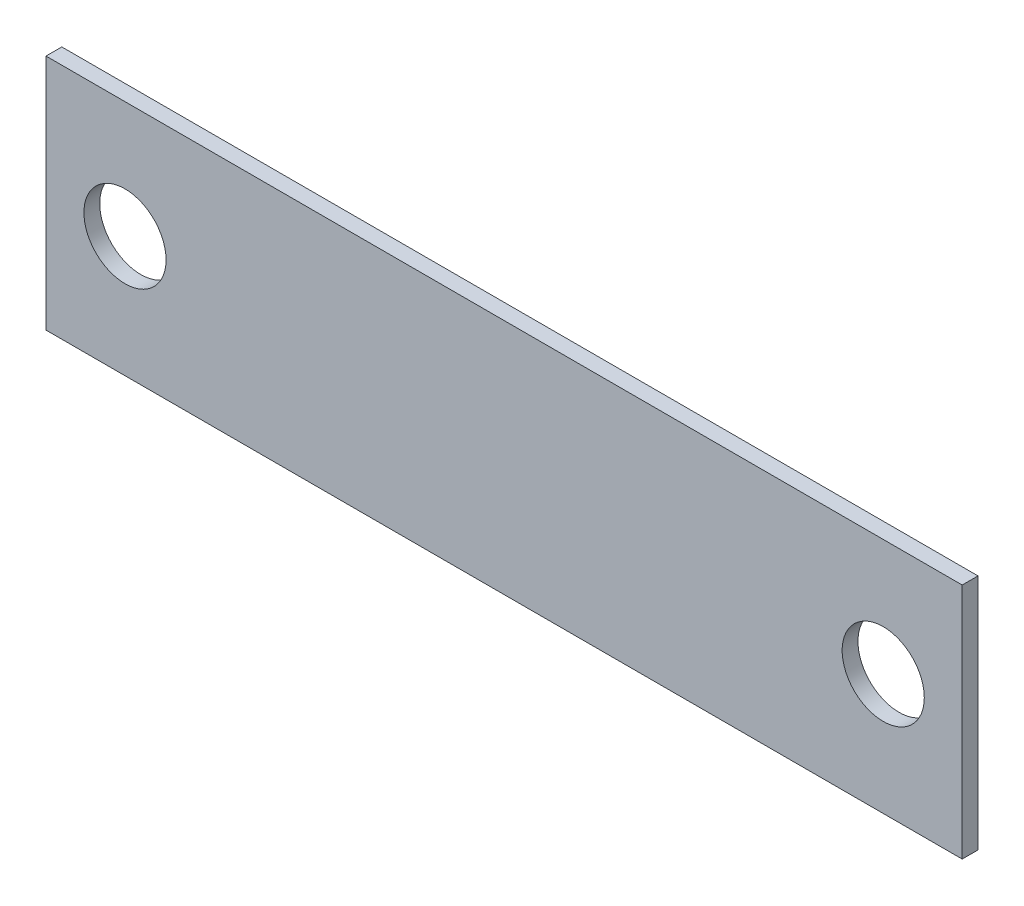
ISO-10303-21;
HEADER;
FILE_DESCRIPTION(('STEP AP214'),'2;1');
FILE_NAME('part.step','',(''),(''),'','','');
FILE_SCHEMA(('AUTOMOTIVE_DESIGN { 1 0 10303 214 1 1 1 1 }'));
ENDSEC;
DATA;
#1=APPLICATION_CONTEXT('core data for automotive mechanical design processes');
#2=APPLICATION_PROTOCOL_DEFINITION('international standard','automotive_design',2000,#1);
#3=PRODUCT_CONTEXT('',#1,'mechanical');
#4=PRODUCT('Part','Part','',(#3));
#5=PRODUCT_RELATED_PRODUCT_CATEGORY('part','',(#4));
#6=PRODUCT_DEFINITION_FORMATION('','',#4);
#7=PRODUCT_DEFINITION_CONTEXT('part definition',#1,'design');
#8=PRODUCT_DEFINITION('design','',#6,#7);
#9=PRODUCT_DEFINITION_SHAPE('','',#8);
#10=(LENGTH_UNIT() NAMED_UNIT(*) SI_UNIT(.MILLI.,.METRE.));
#11=(NAMED_UNIT(*) PLANE_ANGLE_UNIT() SI_UNIT($,.RADIAN.));
#12=(NAMED_UNIT(*) SI_UNIT($,.STERADIAN.) SOLID_ANGLE_UNIT());
#13=UNCERTAINTY_MEASURE_WITH_UNIT(LENGTH_MEASURE(1.E-05),#10,'distance_accuracy_value','');
#14=(GEOMETRIC_REPRESENTATION_CONTEXT(3) GLOBAL_UNCERTAINTY_ASSIGNED_CONTEXT((#13)) GLOBAL_UNIT_ASSIGNED_CONTEXT((#10,
#11,#12)) REPRESENTATION_CONTEXT('',''));
#15=CARTESIAN_POINT('',(0.,0.,0.));
#16=DIRECTION('',(0.,0.,1.));
#17=DIRECTION('',(1.,0.,0.));
#18=AXIS2_PLACEMENT_3D('',#15,#16,#17);
#19=CARTESIAN_POINT('',(-61.5105236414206,29.199175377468,10.));
#20=DIRECTION('',(1.,0.,0.));
#21=DIRECTION('',(0.,1.,0.));
#22=AXIS2_PLACEMENT_3D('',#19,#20,#21);
#23=PLANE('',#22);
#24=DIRECTION('',(0.,-1.,0.));
#25=VECTOR('',#24,1.);
#26=CARTESIAN_POINT('',(-61.5105236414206,29.199175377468,0.));
#27=LINE('',#26,#25);
#28=CARTESIAN_POINT('',(-61.5105236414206,29.199175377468,0.));
#29=VERTEX_POINT('',#28);
#30=CARTESIAN_POINT('',(-61.5105236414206,-121.060824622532,0.));
#31=VERTEX_POINT('',#30);
#32=EDGE_CURVE('E96',#29,#31,#27,.T.);
#33=ORIENTED_EDGE('',*,*,#32,.T.);
#34=DIRECTION('',(0.,0.,-1.));
#35=VECTOR('',#34,1.);
#36=CARTESIAN_POINT('',(-61.5105236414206,-121.060824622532,10.));
#37=LINE('',#36,#35);
#38=CARTESIAN_POINT('',(-61.5105236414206,-121.060824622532,10.));
#39=VERTEX_POINT('',#38);
#40=EDGE_CURVE('E11',#39,#31,#37,.T.);
#41=ORIENTED_EDGE('',*,*,#40,.F.);
#42=DIRECTION('',(0.,-1.,0.));
#43=VECTOR('',#42,1.);
#44=CARTESIAN_POINT('',(-61.5105236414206,29.199175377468,10.));
#45=LINE('',#44,#43);
#46=CARTESIAN_POINT('',(-61.5105236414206,29.199175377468,10.));
#47=VERTEX_POINT('',#46);
#48=EDGE_CURVE('E84',#47,#39,#45,.T.);
#49=ORIENTED_EDGE('',*,*,#48,.F.);
#50=DIRECTION('',(0.,0.,-1.));
#51=VECTOR('',#50,1.);
#52=CARTESIAN_POINT('',(-61.5105236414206,29.199175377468,10.));
#53=LINE('',#52,#51);
#54=EDGE_CURVE('E92',#47,#29,#53,.T.);
#55=ORIENTED_EDGE('',*,*,#54,.T.);
#56=EDGE_LOOP('',(#33,#41,#49,#55));
#57=FACE_BOUND('',#56,.T.);
#58=ADVANCED_FACE('F33',(#57),#23,.F.);
#59=CARTESIAN_POINT('',(-61.5105236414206,-121.060824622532,10.));
#60=DIRECTION('',(0.,1.,0.));
#61=DIRECTION('',(0.,0.,1.));
#62=AXIS2_PLACEMENT_3D('',#59,#60,#61);
#63=PLANE('',#62);
#64=DIRECTION('',(1.,0.,0.));
#65=VECTOR('',#64,1.);
#66=CARTESIAN_POINT('',(-61.5105236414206,-121.060824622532,0.));
#67=LINE('',#66,#65);
#68=CARTESIAN_POINT('',(518.489476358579,-121.060824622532,0.));
#69=VERTEX_POINT('',#68);
#70=EDGE_CURVE('E88',#31,#69,#67,.T.);
#71=ORIENTED_EDGE('',*,*,#70,.T.);
#72=DIRECTION('',(0.,0.,-1.));
#73=VECTOR('',#72,1.);
#74=CARTESIAN_POINT('',(518.489476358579,-121.060824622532,10.));
#75=LINE('',#74,#73);
#76=CARTESIAN_POINT('',(518.489476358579,-121.060824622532,10.));
#77=VERTEX_POINT('',#76);
#78=EDGE_CURVE('E41',#77,#69,#75,.T.);
#79=ORIENTED_EDGE('',*,*,#78,.F.);
#80=DIRECTION('',(1.,0.,0.));
#81=VECTOR('',#80,1.);
#82=CARTESIAN_POINT('',(-61.5105236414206,-121.060824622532,10.));
#83=LINE('',#82,#81);
#84=EDGE_CURVE('E79',#39,#77,#83,.T.);
#85=ORIENTED_EDGE('',*,*,#84,.F.);
#86=ORIENTED_EDGE('',*,*,#40,.T.);
#87=EDGE_LOOP('',(#71,#79,#85,#86));
#88=FACE_BOUND('',#87,.T.);
#89=ADVANCED_FACE('F87',(#88),#63,.F.);
#90=CARTESIAN_POINT('',(518.489476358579,29.1991753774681,10.));
#91=DIRECTION('',(-1.,0.,0.));
#92=DIRECTION('',(0.,0.,1.));
#93=AXIS2_PLACEMENT_3D('',#90,#91,#92);
#94=PLANE('',#93);
#95=DIRECTION('',(0.,1.,0.));
#96=VECTOR('',#95,1.);
#97=CARTESIAN_POINT('',(518.489476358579,29.1991753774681,0.));
#98=LINE('',#97,#96);
#99=CARTESIAN_POINT('',(518.489476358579,29.1991753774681,0.));
#100=VERTEX_POINT('',#99);
#101=EDGE_CURVE('E66',#69,#100,#98,.T.);
#102=ORIENTED_EDGE('',*,*,#101,.T.);
#103=DIRECTION('',(0.,0.,-1.));
#104=VECTOR('',#103,1.);
#105=CARTESIAN_POINT('',(518.489476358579,29.1991753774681,10.));
#106=LINE('',#105,#104);
#107=CARTESIAN_POINT('',(518.489476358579,29.1991753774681,10.));
#108=VERTEX_POINT('',#107);
#109=EDGE_CURVE('E89',#108,#100,#106,.T.);
#110=ORIENTED_EDGE('',*,*,#109,.F.);
#111=DIRECTION('',(0.,1.,0.));
#112=VECTOR('',#111,1.);
#113=CARTESIAN_POINT('',(518.489476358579,29.1991753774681,10.));
#114=LINE('',#113,#112);
#115=EDGE_CURVE('E82',#77,#108,#114,.T.);
#116=ORIENTED_EDGE('',*,*,#115,.F.);
#117=ORIENTED_EDGE('',*,*,#78,.T.);
#118=EDGE_LOOP('',(#102,#110,#116,#117));
#119=FACE_BOUND('',#118,.T.);
#120=ADVANCED_FACE('F90',(#119),#94,.F.);
#121=CARTESIAN_POINT('',(518.489476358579,29.1991753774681,10.));
#122=DIRECTION('',(0.,-1.,0.));
#123=DIRECTION('',(1.,0.,0.));
#124=AXIS2_PLACEMENT_3D('',#121,#122,#123);
#125=PLANE('',#124);
#126=DIRECTION('',(-1.,0.,0.));
#127=VECTOR('',#126,1.);
#128=CARTESIAN_POINT('',(518.489476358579,29.1991753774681,0.));
#129=LINE('',#128,#127);
#130=EDGE_CURVE('E72',#100,#29,#129,.T.);
#131=ORIENTED_EDGE('',*,*,#130,.T.);
#132=ORIENTED_EDGE('',*,*,#54,.F.);
#133=DIRECTION('',(-1.,0.,0.));
#134=VECTOR('',#133,1.);
#135=CARTESIAN_POINT('',(518.489476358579,29.1991753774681,10.));
#136=LINE('',#135,#134);
#137=EDGE_CURVE('E49',#108,#47,#136,.T.);
#138=ORIENTED_EDGE('',*,*,#137,.F.);
#139=ORIENTED_EDGE('',*,*,#109,.T.);
#140=EDGE_LOOP('',(#131,#132,#138,#139));
#141=FACE_BOUND('',#140,.T.);
#142=ADVANCED_FACE('F104',(#141),#125,.F.);
#143=CARTESIAN_POINT('',(0.,0.,10.));
#144=DIRECTION('',(0.,0.,1.));
#145=DIRECTION('',(1.,0.,0.));
#146=AXIS2_PLACEMENT_3D('',#143,#144,#145);
#147=PLANE('',#146);
#148=CARTESIAN_POINT('',(-11.5105236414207,-44.6126158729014,10.));
#149=DIRECTION('',(0.,0.,1.));
#150=DIRECTION('',(1.,0.,0.));
#151=AXIS2_PLACEMENT_3D('',#148,#149,#150);
#152=CIRCLE('',#151,26.);
#153=CARTESIAN_POINT('',(14.4894763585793,-44.6126158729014,10.));
#154=VERTEX_POINT('',#153);
#155=EDGE_CURVE('E116',#154,#154,#152,.T.);
#156=ORIENTED_EDGE('',*,*,#155,.F.);
#157=EDGE_LOOP('',(#156));
#158=FACE_BOUND('',#157,.T.);
#159=CARTESIAN_POINT('',(468.489476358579,-44.6126158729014,10.));
#160=DIRECTION('',(0.,0.,1.));
#161=DIRECTION('',(1.,0.,0.));
#162=AXIS2_PLACEMENT_3D('',#159,#160,#161);
#163=CIRCLE('',#162,26.);
#164=CARTESIAN_POINT('',(494.489476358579,-44.6126158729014,10.));
#165=VERTEX_POINT('',#164);
#166=EDGE_CURVE('E110',#165,#165,#163,.T.);
#167=ORIENTED_EDGE('',*,*,#166,.F.);
#168=EDGE_LOOP('',(#167));
#169=FACE_BOUND('',#168,.T.);
#170=ORIENTED_EDGE('',*,*,#48,.T.);
#171=ORIENTED_EDGE('',*,*,#84,.T.);
#172=ORIENTED_EDGE('',*,*,#115,.T.);
#173=ORIENTED_EDGE('',*,*,#137,.T.);
#174=EDGE_LOOP('',(#170,#171,#172,#173));
#175=FACE_BOUND('',#174,.T.);
#176=ADVANCED_FACE('F80',(#158,#169,#175),#147,.T.);
#177=CARTESIAN_POINT('',(0.,0.,0.));
#178=DIRECTION('',(0.,0.,1.));
#179=DIRECTION('',(1.,0.,0.));
#180=AXIS2_PLACEMENT_3D('',#177,#178,#179);
#181=PLANE('',#180);
#182=CARTESIAN_POINT('',(-11.5105236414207,-44.6126158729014,0.));
#183=DIRECTION('',(0.,0.,1.));
#184=DIRECTION('',(1.,0.,0.));
#185=AXIS2_PLACEMENT_3D('',#182,#183,#184);
#186=CIRCLE('',#185,26.);
#187=CARTESIAN_POINT('',(14.4894763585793,-44.6126158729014,0.));
#188=VERTEX_POINT('',#187);
#189=EDGE_CURVE('E99',#188,#188,#186,.T.);
#190=ORIENTED_EDGE('',*,*,#189,.T.);
#191=EDGE_LOOP('',(#190));
#192=FACE_BOUND('',#191,.T.);
#193=CARTESIAN_POINT('',(468.489476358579,-44.6126158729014,0.));
#194=DIRECTION('',(0.,0.,1.));
#195=DIRECTION('',(1.,0.,0.));
#196=AXIS2_PLACEMENT_3D('',#193,#194,#195);
#197=CIRCLE('',#196,26.);
#198=CARTESIAN_POINT('',(494.489476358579,-44.6126158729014,0.));
#199=VERTEX_POINT('',#198);
#200=EDGE_CURVE('E113',#199,#199,#197,.T.);
#201=ORIENTED_EDGE('',*,*,#200,.T.);
#202=EDGE_LOOP('',(#201));
#203=FACE_BOUND('',#202,.T.);
#204=ORIENTED_EDGE('',*,*,#32,.F.);
#205=ORIENTED_EDGE('',*,*,#130,.F.);
#206=ORIENTED_EDGE('',*,*,#101,.F.);
#207=ORIENTED_EDGE('',*,*,#70,.F.);
#208=EDGE_LOOP('',(#204,#205,#206,#207));
#209=FACE_BOUND('',#208,.T.);
#210=ADVANCED_FACE('F107',(#192,#203,#209),#181,.F.);
#211=CARTESIAN_POINT('',(468.489476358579,-44.6126158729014,0.));
#212=DIRECTION('',(0.,0.,1.));
#213=DIRECTION('',(1.,0.,0.));
#214=AXIS2_PLACEMENT_3D('',#211,#212,#213);
#215=CYLINDRICAL_SURFACE('',#214,26.);
#216=ORIENTED_EDGE('',*,*,#200,.F.);
#217=EDGE_LOOP('',(#216));
#218=FACE_BOUND('',#217,.T.);
#219=ORIENTED_EDGE('',*,*,#166,.T.);
#220=EDGE_LOOP('',(#219));
#221=FACE_BOUND('',#220,.T.);
#222=ADVANCED_FACE('F127',(#218,#221),#215,.F.);
#223=CARTESIAN_POINT('',(-11.5105236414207,-44.6126158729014,0.));
#224=DIRECTION('',(0.,0.,1.));
#225=DIRECTION('',(1.,0.,0.));
#226=AXIS2_PLACEMENT_3D('',#223,#224,#225);
#227=CYLINDRICAL_SURFACE('',#226,26.);
#228=ORIENTED_EDGE('',*,*,#189,.F.);
#229=EDGE_LOOP('',(#228));
#230=FACE_BOUND('',#229,.T.);
#231=ORIENTED_EDGE('',*,*,#155,.T.);
#232=EDGE_LOOP('',(#231));
#233=FACE_BOUND('',#232,.T.);
#234=ADVANCED_FACE('F124',(#230,#233),#227,.F.);
#235=CLOSED_SHELL('',(#58,#89,#120,#142,#176,#210,#222,#234));
#236=MANIFOLD_SOLID_BREP('B2',#235);
#237=ADVANCED_BREP_SHAPE_REPRESENTATION('',(#18,#236),#14);
#238=SHAPE_DEFINITION_REPRESENTATION(#9,#237);
ENDSEC;
END-ISO-10303-21;
